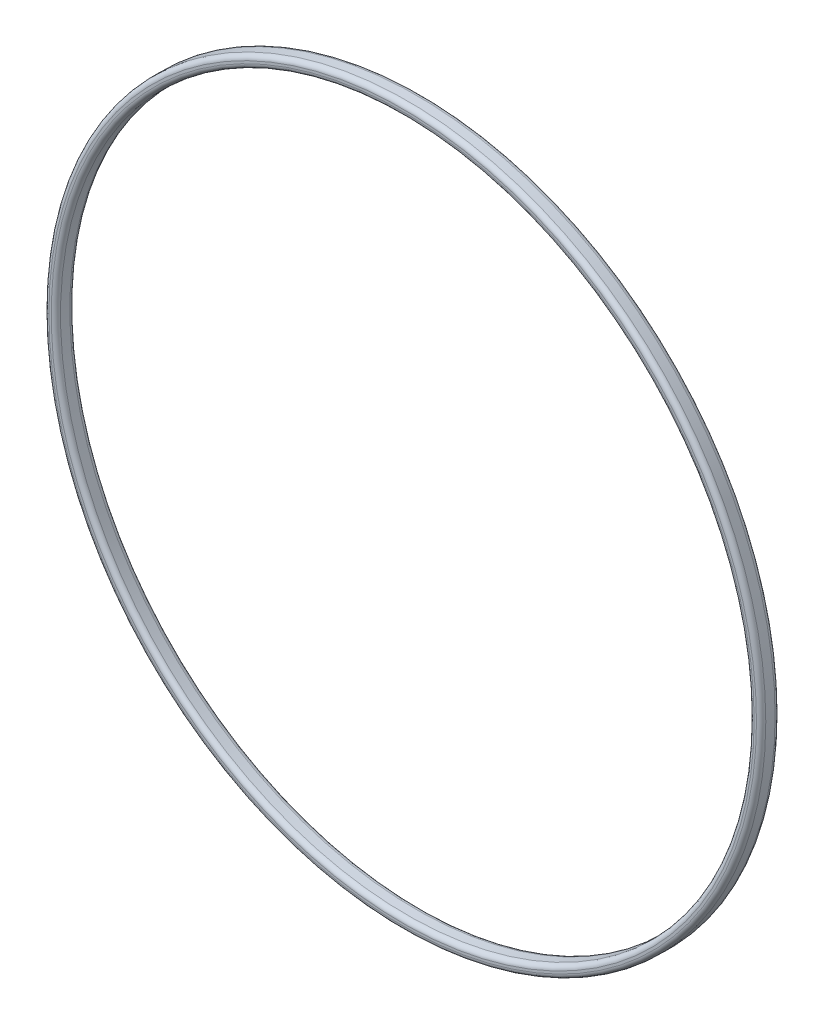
ISO-10303-21;
HEADER;
FILE_DESCRIPTION(('STEP AP214'),'2;1');
FILE_NAME('part.step','',(''),(''),'','','');
FILE_SCHEMA(('AUTOMOTIVE_DESIGN { 1 0 10303 214 1 1 1 1 }'));
ENDSEC;
DATA;
#1=APPLICATION_CONTEXT('core data for automotive mechanical design processes');
#2=APPLICATION_PROTOCOL_DEFINITION('international standard','automotive_design',2000,#1);
#3=PRODUCT_CONTEXT('',#1,'mechanical');
#4=PRODUCT('Part','Part','',(#3));
#5=PRODUCT_RELATED_PRODUCT_CATEGORY('part','',(#4));
#6=PRODUCT_DEFINITION_FORMATION('','',#4);
#7=PRODUCT_DEFINITION_CONTEXT('part definition',#1,'design');
#8=PRODUCT_DEFINITION('design','',#6,#7);
#9=PRODUCT_DEFINITION_SHAPE('','',#8);
#10=(LENGTH_UNIT() NAMED_UNIT(*) SI_UNIT(.MILLI.,.METRE.));
#11=(NAMED_UNIT(*) PLANE_ANGLE_UNIT() SI_UNIT($,.RADIAN.));
#12=(NAMED_UNIT(*) SI_UNIT($,.STERADIAN.) SOLID_ANGLE_UNIT());
#13=UNCERTAINTY_MEASURE_WITH_UNIT(LENGTH_MEASURE(1.E-05),#10,'distance_accuracy_value','');
#14=(GEOMETRIC_REPRESENTATION_CONTEXT(3) GLOBAL_UNCERTAINTY_ASSIGNED_CONTEXT((#13)) GLOBAL_UNIT_ASSIGNED_CONTEXT((#10,
#11,#12)) REPRESENTATION_CONTEXT('',''));
#15=CARTESIAN_POINT('',(0.,0.,0.));
#16=DIRECTION('',(0.,0.,1.));
#17=DIRECTION('',(1.,0.,0.));
#18=AXIS2_PLACEMENT_3D('',#15,#16,#17);
#19=CARTESIAN_POINT('',(0.,0.,-3.45936170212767));
#20=DIRECTION('',(0.,0.,1.));
#21=DIRECTION('',(1.,0.,0.));
#22=AXIS2_PLACEMENT_3D('',#19,#20,#21);
#23=TOROIDAL_SURFACE('',#22,75.5,1.);
#24=CARTESIAN_POINT('',(0.,0.,-4.45936170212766));
#25=DIRECTION('',(0.,0.,1.));
#26=DIRECTION('',(1.,0.,0.));
#27=AXIS2_PLACEMENT_3D('',#24,#25,#26);
#28=CIRCLE('',#27,75.5);
#29=CARTESIAN_POINT('',(75.5,0.,-4.45936170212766));
#30=VERTEX_POINT('',#29);
#31=EDGE_CURVE('E10',#30,#30,#28,.T.);
#32=ORIENTED_EDGE('',*,*,#31,.F.);
#33=EDGE_LOOP('',(#32));
#34=FACE_BOUND('',#33,.T.);
#35=CARTESIAN_POINT('',(0.,0.,-3.45936170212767));
#36=DIRECTION('',(0.,0.,1.));
#37=DIRECTION('',(1.,0.,0.));
#38=AXIS2_PLACEMENT_3D('',#35,#36,#37);
#39=CIRCLE('',#38,74.5);
#40=CARTESIAN_POINT('',(74.5,0.,-3.45936170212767));
#41=VERTEX_POINT('',#40);
#42=EDGE_CURVE('E56',#41,#41,#39,.T.);
#43=ORIENTED_EDGE('',*,*,#42,.T.);
#44=EDGE_LOOP('',(#43));
#45=FACE_BOUND('',#44,.T.);
#46=ADVANCED_FACE('F28',(#34,#45),#23,.T.);
#47=CARTESIAN_POINT('',(0.,76.,-4.45936170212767));
#48=DIRECTION('',(0.,0.,1.));
#49=DIRECTION('',(1.,0.,0.));
#50=AXIS2_PLACEMENT_3D('',#47,#48,#49);
#51=PLANE('',#50);
#52=CARTESIAN_POINT('',(0.,0.,-4.45936170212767));
#53=DIRECTION('',(0.,0.,1.));
#54=DIRECTION('',(1.,0.,0.));
#55=AXIS2_PLACEMENT_3D('',#52,#53,#54);
#56=CIRCLE('',#55,76.);
#57=CARTESIAN_POINT('',(76.,0.,-4.45936170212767));
#58=VERTEX_POINT('',#57);
#59=EDGE_CURVE('E34',#58,#58,#56,.T.);
#60=ORIENTED_EDGE('',*,*,#59,.F.);
#61=EDGE_LOOP('',(#60));
#62=FACE_BOUND('',#61,.T.);
#63=ORIENTED_EDGE('',*,*,#31,.T.);
#64=EDGE_LOOP('',(#63));
#65=FACE_BOUND('',#64,.T.);
#66=ADVANCED_FACE('F93',(#62,#65),#51,.F.);
#67=CARTESIAN_POINT('',(0.,0.,-3.45936170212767));
#68=DIRECTION('',(0.,0.,1.));
#69=DIRECTION('',(1.,0.,0.));
#70=AXIS2_PLACEMENT_3D('',#67,#68,#69);
#71=TOROIDAL_SURFACE('',#70,76.,1.);
#72=CARTESIAN_POINT('',(0.,0.,-3.45936170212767));
#73=DIRECTION('',(0.,0.,1.));
#74=DIRECTION('',(1.,0.,0.));
#75=AXIS2_PLACEMENT_3D('',#72,#73,#74);
#76=CIRCLE('',#75,77.);
#77=CARTESIAN_POINT('',(77.,0.,-3.45936170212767));
#78=VERTEX_POINT('',#77);
#79=EDGE_CURVE('E38',#78,#78,#76,.T.);
#80=ORIENTED_EDGE('',*,*,#79,.F.);
#81=EDGE_LOOP('',(#80));
#82=FACE_BOUND('',#81,.T.);
#83=ORIENTED_EDGE('',*,*,#59,.T.);
#84=EDGE_LOOP('',(#83));
#85=FACE_BOUND('',#84,.T.);
#86=ADVANCED_FACE('F88',(#82,#85),#71,.T.);
#87=CARTESIAN_POINT('',(0.,0.,20.8243971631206));
#88=DIRECTION('',(0.,0.,1.));
#89=DIRECTION('',(1.,0.,0.));
#90=AXIS2_PLACEMENT_3D('',#87,#88,#89);
#91=CYLINDRICAL_SURFACE('',#90,77.);
#92=CARTESIAN_POINT('',(0.,0.,-1.45936170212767));
#93=DIRECTION('',(0.,0.,1.));
#94=DIRECTION('',(1.,0.,0.));
#95=AXIS2_PLACEMENT_3D('',#92,#93,#94);
#96=CIRCLE('',#95,77.);
#97=CARTESIAN_POINT('',(77.,0.,-1.45936170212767));
#98=VERTEX_POINT('',#97);
#99=EDGE_CURVE('E42',#98,#98,#96,.T.);
#100=ORIENTED_EDGE('',*,*,#99,.F.);
#101=EDGE_LOOP('',(#100));
#102=FACE_BOUND('',#101,.T.);
#103=ORIENTED_EDGE('',*,*,#79,.T.);
#104=EDGE_LOOP('',(#103));
#105=FACE_BOUND('',#104,.T.);
#106=ADVANCED_FACE('F82',(#102,#105),#91,.T.);
#107=CARTESIAN_POINT('',(0.,0.,-1.45936170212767));
#108=DIRECTION('',(0.,0.,1.));
#109=DIRECTION('',(1.,0.,0.));
#110=AXIS2_PLACEMENT_3D('',#107,#108,#109);
#111=TOROIDAL_SURFACE('',#110,76.,1.);
#112=CARTESIAN_POINT('',(0.,0.,-0.459361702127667));
#113=DIRECTION('',(0.,0.,1.));
#114=DIRECTION('',(1.,0.,0.));
#115=AXIS2_PLACEMENT_3D('',#112,#113,#114);
#116=CIRCLE('',#115,76.);
#117=CARTESIAN_POINT('',(76.,0.,-0.459361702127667));
#118=VERTEX_POINT('',#117);
#119=EDGE_CURVE('E47',#118,#118,#116,.T.);
#120=ORIENTED_EDGE('',*,*,#119,.F.);
#121=EDGE_LOOP('',(#120));
#122=FACE_BOUND('',#121,.T.);
#123=ORIENTED_EDGE('',*,*,#99,.T.);
#124=EDGE_LOOP('',(#123));
#125=FACE_BOUND('',#124,.T.);
#126=ADVANCED_FACE('F76',(#122,#125),#111,.T.);
#127=CARTESIAN_POINT('',(0.,76.,-0.459361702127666));
#128=DIRECTION('',(0.,0.,-1.));
#129=DIRECTION('',(-1.,0.,0.));
#130=AXIS2_PLACEMENT_3D('',#127,#128,#129);
#131=PLANE('',#130);
#132=CARTESIAN_POINT('',(0.,0.,-0.459361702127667));
#133=DIRECTION('',(0.,0.,1.));
#134=DIRECTION('',(1.,0.,0.));
#135=AXIS2_PLACEMENT_3D('',#132,#133,#134);
#136=CIRCLE('',#135,75.5);
#137=CARTESIAN_POINT('',(75.5,0.,-0.459361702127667));
#138=VERTEX_POINT('',#137);
#139=EDGE_CURVE('E50',#138,#138,#136,.T.);
#140=ORIENTED_EDGE('',*,*,#139,.F.);
#141=EDGE_LOOP('',(#140));
#142=FACE_BOUND('',#141,.T.);
#143=ORIENTED_EDGE('',*,*,#119,.T.);
#144=EDGE_LOOP('',(#143));
#145=FACE_BOUND('',#144,.T.);
#146=ADVANCED_FACE('F70',(#142,#145),#131,.F.);
#147=CARTESIAN_POINT('',(0.,0.,-1.45936170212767));
#148=DIRECTION('',(0.,0.,1.));
#149=DIRECTION('',(1.,0.,0.));
#150=AXIS2_PLACEMENT_3D('',#147,#148,#149);
#151=TOROIDAL_SURFACE('',#150,75.5,1.);
#152=CARTESIAN_POINT('',(0.,0.,-1.45936170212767));
#153=DIRECTION('',(0.,0.,1.));
#154=DIRECTION('',(1.,0.,0.));
#155=AXIS2_PLACEMENT_3D('',#152,#153,#154);
#156=CIRCLE('',#155,74.5);
#157=CARTESIAN_POINT('',(74.5,0.,-1.45936170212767));
#158=VERTEX_POINT('',#157);
#159=EDGE_CURVE('E53',#158,#158,#156,.T.);
#160=ORIENTED_EDGE('',*,*,#159,.F.);
#161=EDGE_LOOP('',(#160));
#162=FACE_BOUND('',#161,.T.);
#163=ORIENTED_EDGE('',*,*,#139,.T.);
#164=EDGE_LOOP('',(#163));
#165=FACE_BOUND('',#164,.T.);
#166=ADVANCED_FACE('F64',(#162,#165),#151,.T.);
#167=CARTESIAN_POINT('',(0.,0.,20.8243971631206));
#168=DIRECTION('',(0.,0.,1.));
#169=DIRECTION('',(1.,0.,0.));
#170=AXIS2_PLACEMENT_3D('',#167,#168,#169);
#171=CYLINDRICAL_SURFACE('',#170,74.5);
#172=ORIENTED_EDGE('',*,*,#42,.F.);
#173=EDGE_LOOP('',(#172));
#174=FACE_BOUND('',#173,.T.);
#175=ORIENTED_EDGE('',*,*,#159,.T.);
#176=EDGE_LOOP('',(#175));
#177=FACE_BOUND('',#176,.T.);
#178=ADVANCED_FACE('F61',(#174,#177),#171,.F.);
#179=CLOSED_SHELL('',(#46,#66,#86,#106,#126,#146,#166,#178));
#180=MANIFOLD_SOLID_BREP('B2',#179);
#181=ADVANCED_BREP_SHAPE_REPRESENTATION('',(#18,#180),#14);
#182=SHAPE_DEFINITION_REPRESENTATION(#9,#181);
ENDSEC;
END-ISO-10303-21;
